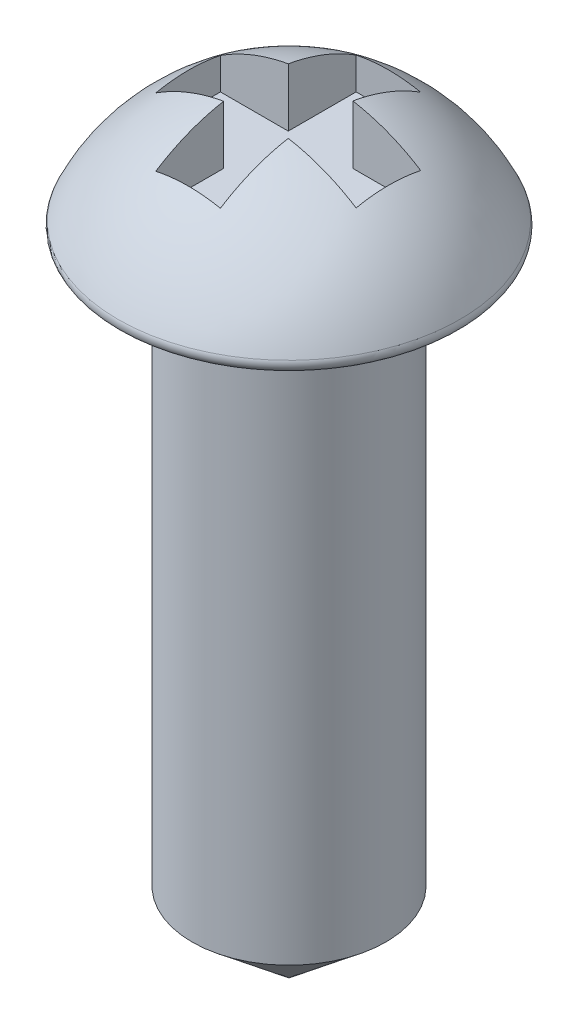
from build123d import *

# Parameters (mm, degrees)
CONG_1_R                = 0.1
ENL_V_MAT_EXTRU_1_DEPTH = 0.5


with BuildPart() as part:
    # Esquisse1 → R_volution1 (revolve)
    with BuildSketch(Plane.XY, mode=Mode.PRIVATE) as r_volution1_sk:
        with BuildLine():
            Line((2, 0), (1.1, 0))
            Line((1.1, 0), (1.1, -6.4))
            Line((1.1, -6.4), (0, -7.302889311))
            Line((0, -7.302889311), (0, 1.382388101))
            ThreePointArc((0, 1.382388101), (1.215627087, 1.003157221), (2, 0))
        make_face()
    revolve(r_volution1_sk.sketch.rotate(Axis((0, 3.800054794, 0), (0, -1, 0)), 90), axis=Axis((0, 3.800054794, 0), (0, -1, 0)))

    # Cong_1
    cong_1_edges = [part.edges().sort_by_distance(p)[0] for p in [
        (0, 0, -2),
    ]]
    fillet(cong_1_edges, radius=CONG_1_R)

    # Esquisse2 → Enl_v. mat.-Extru.1 (cut, symmetric)
    with BuildSketch(Plane(origin=(0, 1.15653742, 0), x_dir=(-1, 0, 0), z_dir=(0, 1, 0))):
        Polygon((-0.361948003, 1.140760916), (0.37159995, 1.140760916), (0.37159995, 0.37038863), (1.141972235, 0.37038863), (1.141972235, -0.363159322), (0.37159995, -0.363159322), (0.37159995, -1.133531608), (-0.361948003, -1.133531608), (-0.361948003, -0.363159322), (-1.132320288, -0.363159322), (-1.132320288, 0.37038863), (-0.361948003, 0.37038863), align=None)
    extrude(amount=ENL_V_MAT_EXTRU_1_DEPTH, both=True, mode=Mode.SUBTRACT)


solid = part.part
